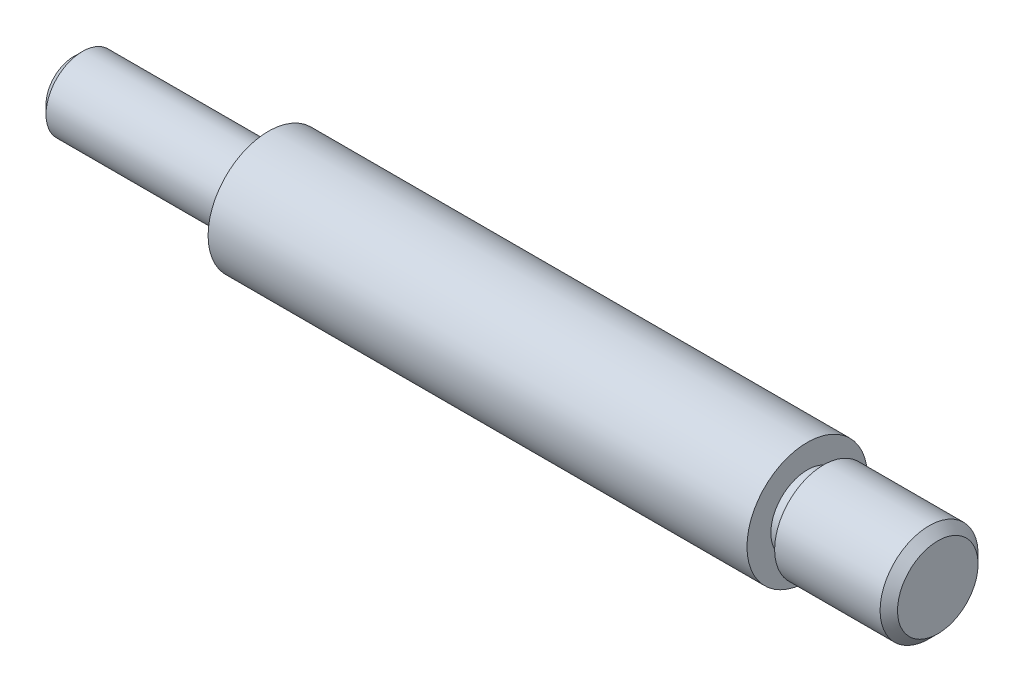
from build123d import *

# Parameters (mm, degrees)
CHANFREIN1_SIZE = 2


with BuildPart() as part:
    # Esquisse1 → R_volution1 (revolve)
    with BuildSketch(Plane.XY, mode=Mode.PRIVATE) as r_volution1_sk:
        Polygon((-94.416079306, 25.372410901), (-49.735691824, 25.372410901), (-49.735691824, 30.850545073), (73.954811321, 30.850545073), (73.954811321, 25.372410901), (77.703008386, 25.372410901), (77.703008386, 28.255639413), (103.914482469, 28.255639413), (103.914482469, 17.011048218), (-94.416079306, 17.011048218), align=None)
    revolve(r_volution1_sk.sketch.rotate(Axis((-85.776048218, 17.011048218, 0), (1, 0, 0)), 90), axis=Axis((-85.776048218, 17.011048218, 0), (1, 0, 0)))

    # Chanfrein1
    chanfrein1_edges = [part.edges().sort_by_distance(p)[0] for p in [
        (-94.416079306, 17.011048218, -8.361362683),
        (103.914482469, 17.011048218, -11.244591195),
    ]]
    chamfer(chanfrein1_edges, length=CHANFREIN1_SIZE)


solid = part.part
